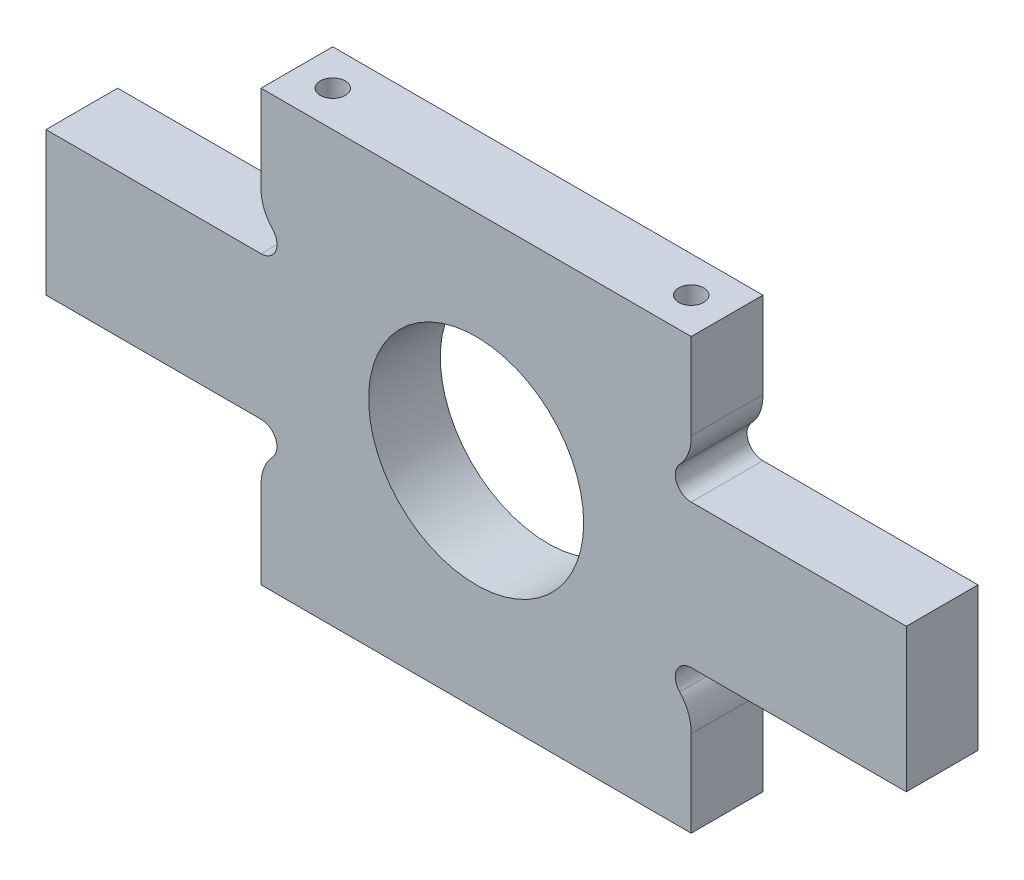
from build123d import *

# Parameters (mm, degrees)
BOSS_EXTRU_1_DEPTH              = 10
ESQUISSE3_R                     = 15
ENL_V_MAT_EXTRU_2_DEPTH         = 10
DIAM_TRE_DU_PER_AGE_3_5_3_5_1_D = 3.5


with BuildPart() as part:
    # Esquisse1 → Boss.-Extru.1 (new body)
    with BuildSketch(Plane.XY):
        with BuildLine():
            Line((30, -10), (60, -10))
            Line((60, -10), (60, 10))
            Line((60, 10), (30, 10))
            ThreePointArc((30, 10), (27.963202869, 11.336904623), (28.379562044, 13.737425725))
            ThreePointArc((28.379562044, 13.737425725), (29.610524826, 15.708765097), (30, 18))
            Line((30, 18), (30, 30))
            Line((30, 30), (-30, 30))
            Line((-30, 30), (-30, 18))
            ThreePointArc((-30, 18), (-29.610524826, 15.708765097), (-28.379562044, 13.737425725))
            ThreePointArc((-28.379562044, 13.737425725), (-27.963202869, 11.336904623), (-30, 10))
            Line((-30, 10), (-60, 10))
            Line((-60, 10), (-60, -10))
            Line((-60, -10), (-30, -10))
            ThreePointArc((-30, -10), (-27.963202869, -11.336904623), (-28.379562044, -13.737425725))
            ThreePointArc((-28.379562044, -13.737425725), (-29.609361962, -15.709008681), (-29.99782814, -18))
            Line((-29.99782814, -18), (-29.99782814, -30))
            Line((-29.99782814, -30), (29.99782814, -30))
            Line((29.99782814, -30), (29.99782814, -18))
            ThreePointArc((29.99782814, -18), (29.609361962, -15.709008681), (28.379562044, -13.737425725))
            ThreePointArc((28.379562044, -13.737425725), (27.963202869, -11.336904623), (30, -10))
        make_face()
    extrude(amount=BOSS_EXTRU_1_DEPTH)

    # Esquisse3 → Enl_v. mat.-Extru.2 (cut)
    with BuildSketch(Plane.XY.offset(10)):
        Circle(ESQUISSE3_R)
    extrude(amount=-ENL_V_MAT_EXTRU_2_DEPTH, mode=Mode.SUBTRACT)

    # Diam_tre du per_age _3.5 _3.5_1 (through all)
    with Locations(Plane(origin=(0, 30, 0), x_dir=(1, 0, 0), z_dir=(0, 1, 0))):
        with Locations((-25, -5), (25, -5)):
            diam_tre_du_per_age_3_5_3_5_1 = Hole(DIAM_TRE_DU_PER_AGE_3_5_3_5_1_D / 2)

    # Sym_trie1: Diam_tre du per_age _3.5 _3.5_1 across plane
    add(diam_tre_du_per_age_3_5_3_5_1.mirror(Plane.ZX), mode=Mode.SUBTRACT)


solid = part.part
